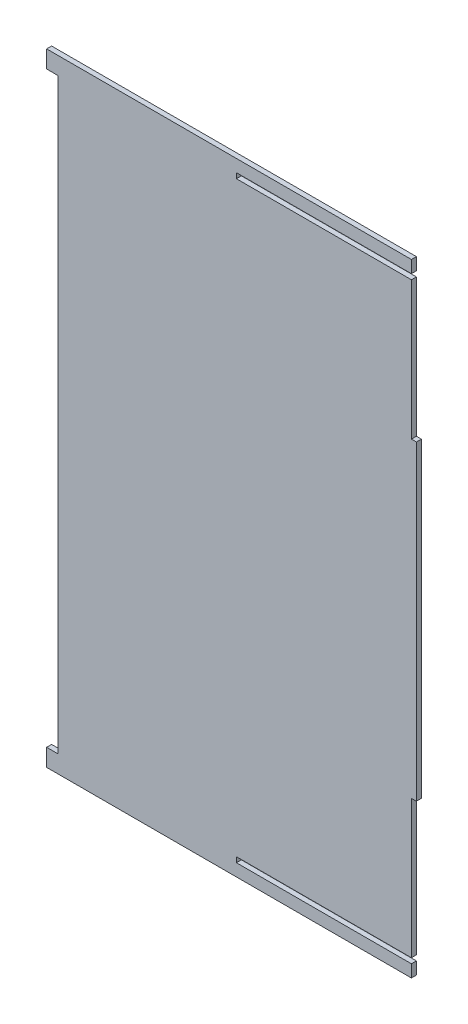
from build123d import *

# Parameters (mm, degrees)
EXTRUDE_1_DEPTH = 4


with BuildPart() as part:
    # Model → Extrude 1 (new body)
    with BuildSketch(Plane.XY):
        Polygon((-2112.0287, -320.2575), (-2112.0287, -431.1574), (-2108.0287, -431.1574), (-2108.0287, -681.1574), (-2112.0287, -681.1574), (-2112.0287, -792.0574), (-2252.6512, -792.0574), (-2252.6512, -792.1574), (-2252.6512, -796.1574), (-2252.6512, -796.2574), (-2112.0287, -796.2574), (-2112.0287, -806.1574), (-2405.1329, -806.1574), (-2405.1329, -792.1574), (-2396.0286, -792.1574), (-2396.0286, -320.1574), (-2405.1329, -320.1574), (-2405.1329, -306.1574), (-2112.0287, -306.1574), (-2112.0287, -316.0575), (-2252.6512, -316.0575), (-2252.6512, -316.1574), (-2252.6512, -320.1574), (-2252.6512, -320.2575), align=None)
    extrude(amount=EXTRUDE_1_DEPTH)


solid = part.part
